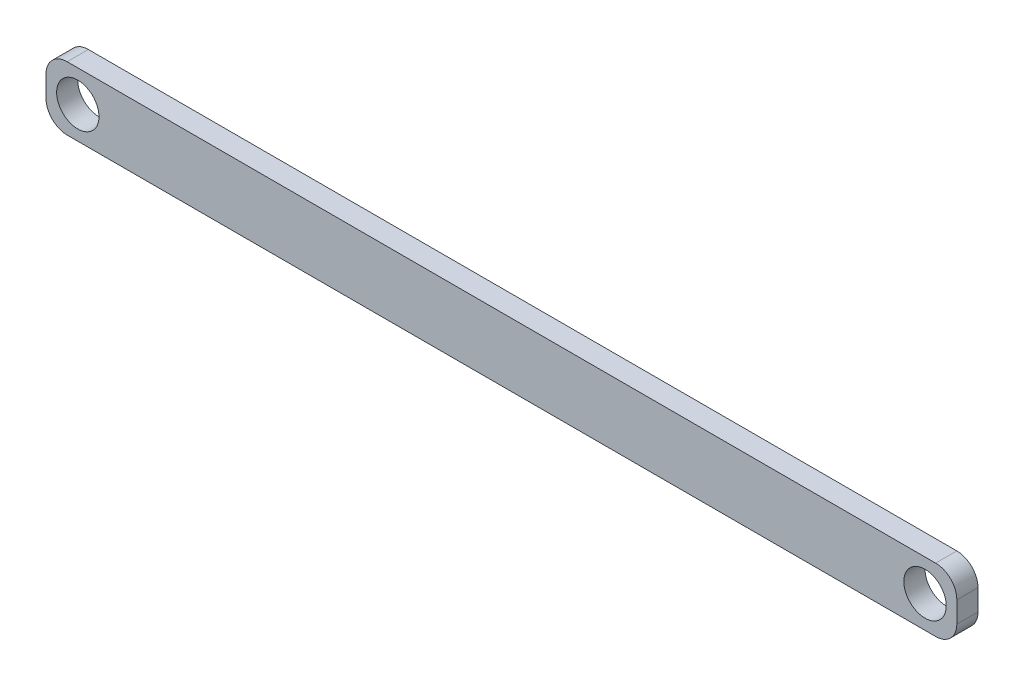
from build123d import *

# Parameters (mm, degrees)
CROQUIS1_R              = 10
SALIENTE_EXTRUIR2_DEPTH = 5


with BuildPart() as part:
    # Croquis1 → Saliente-Extruir2 (new, symmetric)
    with BuildSketch(Plane.XY):
        with BuildLine():
            Line((-205, 15), (205, 15))
            ThreePointArc((205, 15), (212.071067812, 12.071067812), (215, 5))
            Line((215, 5), (215, -5))
            ThreePointArc((215, -5), (212.071067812, -12.071067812), (205, -15))
            Line((205, -15), (-205, -15))
            ThreePointArc((-205, -15), (-212.071067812, -12.071067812), (-215, -5))
            Line((-215, -5), (-215, 5))
            ThreePointArc((-215, 5), (-212.071067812, 12.071067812), (-205, 15))
        make_face()
        with Locations((-200, 0)):
            Circle(CROQUIS1_R, mode=Mode.SUBTRACT)
        with Locations((200, 0)):
            Circle(CROQUIS1_R, mode=Mode.SUBTRACT)
    extrude(amount=SALIENTE_EXTRUIR2_DEPTH, both=True)


solid = part.part
